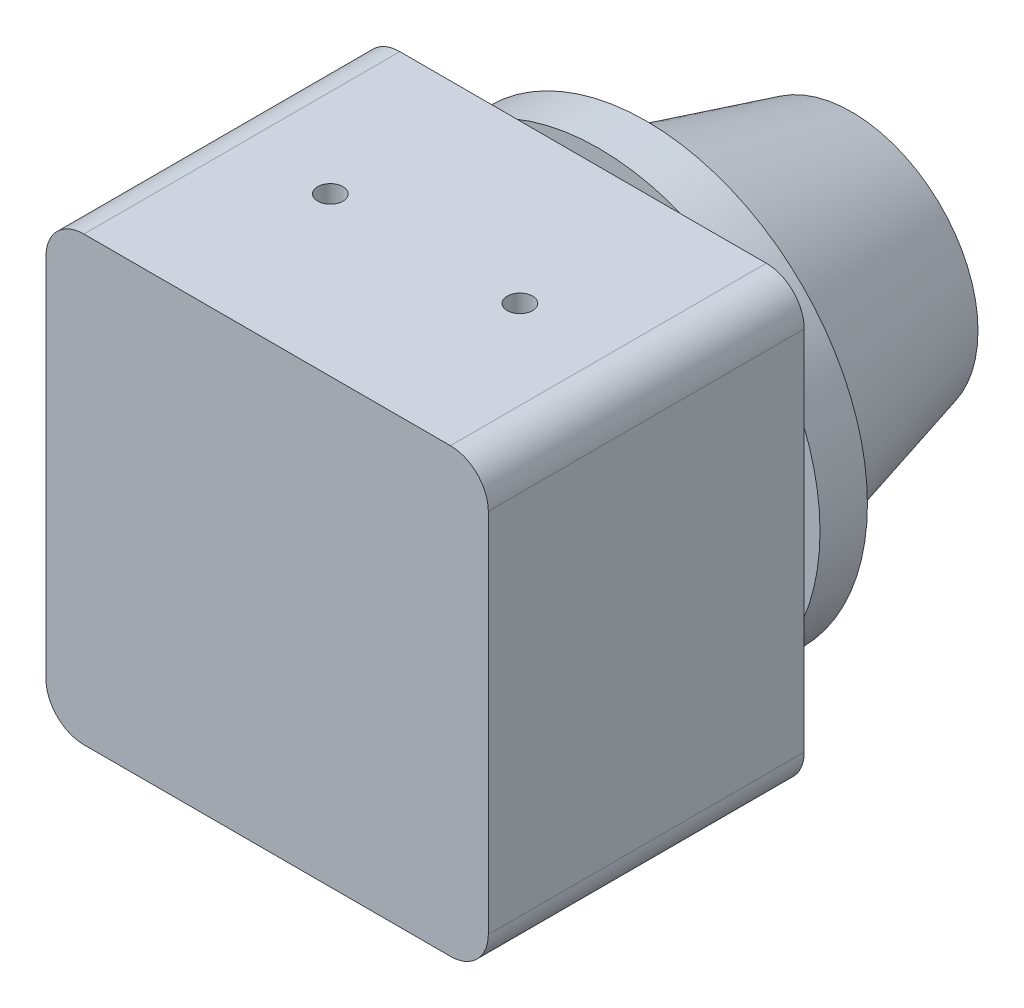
ISO-10303-21;
HEADER;
FILE_DESCRIPTION(('STEP AP214'),'2;1');
FILE_NAME('part.step','',(''),(''),'','','');
FILE_SCHEMA(('AUTOMOTIVE_DESIGN { 1 0 10303 214 1 1 1 1 }'));
ENDSEC;
DATA;
#1=APPLICATION_CONTEXT('core data for automotive mechanical design processes');
#2=APPLICATION_PROTOCOL_DEFINITION('international standard','automotive_design',2000,#1);
#3=PRODUCT_CONTEXT('',#1,'mechanical');
#4=PRODUCT('Part','Part','',(#3));
#5=PRODUCT_RELATED_PRODUCT_CATEGORY('part','',(#4));
#6=PRODUCT_DEFINITION_FORMATION('','',#4);
#7=PRODUCT_DEFINITION_CONTEXT('part definition',#1,'design');
#8=PRODUCT_DEFINITION('design','',#6,#7);
#9=PRODUCT_DEFINITION_SHAPE('','',#8);
#10=(LENGTH_UNIT() NAMED_UNIT(*) SI_UNIT(.MILLI.,.METRE.));
#11=(NAMED_UNIT(*) PLANE_ANGLE_UNIT() SI_UNIT($,.RADIAN.));
#12=(NAMED_UNIT(*) SI_UNIT($,.STERADIAN.) SOLID_ANGLE_UNIT());
#13=UNCERTAINTY_MEASURE_WITH_UNIT(LENGTH_MEASURE(1.E-05),#10,'distance_accuracy_value','');
#14=(GEOMETRIC_REPRESENTATION_CONTEXT(3) GLOBAL_UNCERTAINTY_ASSIGNED_CONTEXT((#13)) GLOBAL_UNIT_ASSIGNED_CONTEXT((#10,
#11,#12)) REPRESENTATION_CONTEXT('',''));
#15=CARTESIAN_POINT('',(0.,0.,0.));
#16=DIRECTION('',(0.,0.,1.));
#17=DIRECTION('',(1.,0.,0.));
#18=AXIS2_PLACEMENT_3D('',#15,#16,#17);
#19=CARTESIAN_POINT('',(158.115,145.415,0.));
#20=DIRECTION('',(0.,0.,1.));
#21=DIRECTION('',(1.,0.,0.));
#22=AXIS2_PLACEMENT_3D('',#19,#20,#21);
#23=PLANE('',#22);
#24=CARTESIAN_POINT('',(158.115,145.415,0.));
#25=DIRECTION('',(0.,0.,1.));
#26=DIRECTION('',(1.,0.,0.));
#27=AXIS2_PLACEMENT_3D('',#24,#25,#26);
#28=CIRCLE('',#27,3.81000000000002);
#29=CARTESIAN_POINT('',(161.925,145.415,0.));
#30=VERTEX_POINT('',#29);
#31=CARTESIAN_POINT('',(158.115,149.225,0.));
#32=VERTEX_POINT('',#31);
#33=EDGE_CURVE('E132',#30,#32,#28,.T.);
#34=ORIENTED_EDGE('',*,*,#33,.F.);
#35=DIRECTION('',(0.,1.,0.));
#36=VECTOR('',#35,1.);
#37=CARTESIAN_POINT('',(161.925,145.415,0.));
#38=LINE('',#37,#36);
#39=CARTESIAN_POINT('',(161.925,108.585,0.));
#40=VERTEX_POINT('',#39);
#41=EDGE_CURVE('E86',#40,#30,#38,.T.);
#42=ORIENTED_EDGE('',*,*,#41,.F.);
#43=CARTESIAN_POINT('',(158.115,108.585,0.));
#44=DIRECTION('',(0.,0.,1.));
#45=DIRECTION('',(1.,0.,0.));
#46=AXIS2_PLACEMENT_3D('',#43,#44,#45);
#47=CIRCLE('',#46,3.80999999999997);
#48=CARTESIAN_POINT('',(158.115,104.775,0.));
#49=VERTEX_POINT('',#48);
#50=EDGE_CURVE('E80',#49,#40,#47,.T.);
#51=ORIENTED_EDGE('',*,*,#50,.F.);
#52=DIRECTION('',(1.,0.,0.));
#53=VECTOR('',#52,1.);
#54=CARTESIAN_POINT('',(158.115,104.775,0.));
#55=LINE('',#54,#53);
#56=CARTESIAN_POINT('',(121.285,104.775,0.));
#57=VERTEX_POINT('',#56);
#58=EDGE_CURVE('E122',#57,#49,#55,.T.);
#59=ORIENTED_EDGE('',*,*,#58,.F.);
#60=CARTESIAN_POINT('',(121.285,108.585,0.));
#61=DIRECTION('',(0.,0.,1.));
#62=DIRECTION('',(-1.,0.,0.));
#63=AXIS2_PLACEMENT_3D('',#60,#61,#62);
#64=CIRCLE('',#63,3.80999999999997);
#65=CARTESIAN_POINT('',(117.475,108.585,0.));
#66=VERTEX_POINT('',#65);
#67=EDGE_CURVE('E142',#66,#57,#64,.T.);
#68=ORIENTED_EDGE('',*,*,#67,.F.);
#69=DIRECTION('',(0.,-1.,0.));
#70=VECTOR('',#69,1.);
#71=CARTESIAN_POINT('',(117.475,145.415,0.));
#72=LINE('',#71,#70);
#73=CARTESIAN_POINT('',(117.475,145.415,0.));
#74=VERTEX_POINT('',#73);
#75=EDGE_CURVE('E140',#74,#66,#72,.T.);
#76=ORIENTED_EDGE('',*,*,#75,.F.);
#77=CARTESIAN_POINT('',(121.285,145.415,0.));
#78=DIRECTION('',(0.,0.,1.));
#79=DIRECTION('',(-1.,0.,0.));
#80=AXIS2_PLACEMENT_3D('',#77,#78,#79);
#81=CIRCLE('',#80,3.81);
#82=CARTESIAN_POINT('',(121.285,149.225,0.));
#83=VERTEX_POINT('',#82);
#84=EDGE_CURVE('E138',#83,#74,#81,.T.);
#85=ORIENTED_EDGE('',*,*,#84,.F.);
#86=DIRECTION('',(-1.,0.,0.));
#87=VECTOR('',#86,1.);
#88=CARTESIAN_POINT('',(158.115,149.225,0.));
#89=LINE('',#88,#87);
#90=EDGE_CURVE('E135',#32,#83,#89,.T.);
#91=ORIENTED_EDGE('',*,*,#90,.F.);
#92=EDGE_LOOP('',(#34,#42,#51,#59,#68,#76,#85,#91));
#93=FACE_BOUND('',#92,.T.);
#94=CARTESIAN_POINT('',(139.7,127.,0.));
#95=DIRECTION('',(0.,0.,1.));
#96=DIRECTION('',(1.,0.,0.));
#97=AXIS2_PLACEMENT_3D('',#94,#95,#96);
#98=CIRCLE('',#97,13.97);
#99=CARTESIAN_POINT('',(153.67,127.,0.));
#100=VERTEX_POINT('',#99);
#101=EDGE_CURVE('E11',#100,#100,#98,.F.);
#102=ORIENTED_EDGE('',*,*,#101,.F.);
#103=EDGE_LOOP('',(#102));
#104=FACE_BOUND('',#103,.T.);
#105=ADVANCED_FACE('F34',(#93,#104),#23,.F.);
#106=CARTESIAN_POINT('',(158.115,145.415,31.75));
#107=DIRECTION('',(0.,0.,-1.));
#108=DIRECTION('',(-1.,0.,0.));
#109=AXIS2_PLACEMENT_3D('',#106,#107,#108);
#110=CYLINDRICAL_SURFACE('',#109,3.81000000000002);
#111=ORIENTED_EDGE('',*,*,#33,.T.);
#112=DIRECTION('',(0.,0.,-1.));
#113=VECTOR('',#112,1.);
#114=CARTESIAN_POINT('',(158.115,149.225,31.75));
#115=LINE('',#114,#113);
#116=CARTESIAN_POINT('',(158.115,149.225,31.75));
#117=VERTEX_POINT('',#116);
#118=EDGE_CURVE('E43',#117,#32,#115,.T.);
#119=ORIENTED_EDGE('',*,*,#118,.F.);
#120=CARTESIAN_POINT('',(158.115,145.415,31.75));
#121=DIRECTION('',(0.,0.,1.));
#122=DIRECTION('',(1.,0.,0.));
#123=AXIS2_PLACEMENT_3D('',#120,#121,#122);
#124=CIRCLE('',#123,3.81000000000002);
#125=CARTESIAN_POINT('',(161.925,145.415,31.75));
#126=VERTEX_POINT('',#125);
#127=EDGE_CURVE('E147',#126,#117,#124,.T.);
#128=ORIENTED_EDGE('',*,*,#127,.F.);
#129=DIRECTION('',(0.,0.,-1.));
#130=VECTOR('',#129,1.);
#131=CARTESIAN_POINT('',(161.925,145.415,31.75));
#132=LINE('',#131,#130);
#133=EDGE_CURVE('E128',#126,#30,#132,.T.);
#134=ORIENTED_EDGE('',*,*,#133,.T.);
#135=EDGE_LOOP('',(#111,#119,#128,#134));
#136=FACE_BOUND('',#135,.T.);
#137=ADVANCED_FACE('F36',(#136),#110,.T.);
#138=CARTESIAN_POINT('',(158.115,149.225,31.75));
#139=DIRECTION('',(0.,-1.,0.));
#140=DIRECTION('',(1.,0.,0.));
#141=AXIS2_PLACEMENT_3D('',#138,#139,#140);
#142=PLANE('',#141);
#143=CARTESIAN_POINT('',(149.225,149.225,15.875));
#144=DIRECTION('',(0.,1.,0.));
#145=DIRECTION('',(-1.,0.,0.));
#146=AXIS2_PLACEMENT_3D('',#143,#144,#145);
#147=CIRCLE('',#146,1.27);
#148=CARTESIAN_POINT('',(147.955,149.225,15.875));
#149=VERTEX_POINT('',#148);
#150=EDGE_CURVE('E205',#149,#149,#147,.T.);
#151=ORIENTED_EDGE('',*,*,#150,.F.);
#152=EDGE_LOOP('',(#151));
#153=FACE_BOUND('',#152,.T.);
#154=CARTESIAN_POINT('',(130.175,149.225,15.875));
#155=DIRECTION('',(0.,1.,0.));
#156=DIRECTION('',(-1.,0.,0.));
#157=AXIS2_PLACEMENT_3D('',#154,#155,#156);
#158=CIRCLE('',#157,1.27);
#159=CARTESIAN_POINT('',(128.905,149.225,15.875));
#160=VERTEX_POINT('',#159);
#161=EDGE_CURVE('E199',#160,#160,#158,.T.);
#162=ORIENTED_EDGE('',*,*,#161,.F.);
#163=EDGE_LOOP('',(#162));
#164=FACE_BOUND('',#163,.T.);
#165=ORIENTED_EDGE('',*,*,#90,.T.);
#166=DIRECTION('',(0.,0.,-1.));
#167=VECTOR('',#166,1.);
#168=CARTESIAN_POINT('',(121.285,149.225,31.75));
#169=LINE('',#168,#167);
#170=CARTESIAN_POINT('',(121.285,149.225,31.75));
#171=VERTEX_POINT('',#170);
#172=EDGE_CURVE('E157',#171,#83,#169,.T.);
#173=ORIENTED_EDGE('',*,*,#172,.F.);
#174=DIRECTION('',(-1.,0.,0.));
#175=VECTOR('',#174,1.);
#176=CARTESIAN_POINT('',(158.115,149.225,31.75));
#177=LINE('',#176,#175);
#178=EDGE_CURVE('E95',#117,#171,#177,.T.);
#179=ORIENTED_EDGE('',*,*,#178,.F.);
#180=ORIENTED_EDGE('',*,*,#118,.T.);
#181=EDGE_LOOP('',(#165,#173,#179,#180));
#182=FACE_BOUND('',#181,.T.);
#183=ADVANCED_FACE('F160',(#153,#164,#182),#142,.F.);
#184=CARTESIAN_POINT('',(121.285,145.415,31.75));
#185=DIRECTION('',(0.,0.,-1.));
#186=DIRECTION('',(-1.,0.,0.));
#187=AXIS2_PLACEMENT_3D('',#184,#185,#186);
#188=CYLINDRICAL_SURFACE('',#187,3.81);
#189=ORIENTED_EDGE('',*,*,#84,.T.);
#190=DIRECTION('',(0.,0.,-1.));
#191=VECTOR('',#190,1.);
#192=CARTESIAN_POINT('',(117.475,145.415,31.75));
#193=LINE('',#192,#191);
#194=CARTESIAN_POINT('',(117.475,145.415,31.75));
#195=VERTEX_POINT('',#194);
#196=EDGE_CURVE('E154',#195,#74,#193,.T.);
#197=ORIENTED_EDGE('',*,*,#196,.F.);
#198=CARTESIAN_POINT('',(121.285,145.415,31.75));
#199=DIRECTION('',(0.,0.,1.));
#200=DIRECTION('',(-1.,0.,0.));
#201=AXIS2_PLACEMENT_3D('',#198,#199,#200);
#202=CIRCLE('',#201,3.81);
#203=EDGE_CURVE('E178',#171,#195,#202,.T.);
#204=ORIENTED_EDGE('',*,*,#203,.F.);
#205=ORIENTED_EDGE('',*,*,#172,.T.);
#206=EDGE_LOOP('',(#189,#197,#204,#205));
#207=FACE_BOUND('',#206,.T.);
#208=ADVANCED_FACE('F171',(#207),#188,.T.);
#209=CARTESIAN_POINT('',(117.475,145.415,31.75));
#210=DIRECTION('',(1.,0.,0.));
#211=DIRECTION('',(0.,0.,-1.));
#212=AXIS2_PLACEMENT_3D('',#209,#210,#211);
#213=PLANE('',#212);
#214=ORIENTED_EDGE('',*,*,#75,.T.);
#215=DIRECTION('',(0.,0.,-1.));
#216=VECTOR('',#215,1.);
#217=CARTESIAN_POINT('',(117.475,108.585,31.75));
#218=LINE('',#217,#216);
#219=CARTESIAN_POINT('',(117.475,108.585,31.75));
#220=VERTEX_POINT('',#219);
#221=EDGE_CURVE('E151',#220,#66,#218,.T.);
#222=ORIENTED_EDGE('',*,*,#221,.F.);
#223=DIRECTION('',(0.,-1.,0.));
#224=VECTOR('',#223,1.);
#225=CARTESIAN_POINT('',(117.475,145.415,31.75));
#226=LINE('',#225,#224);
#227=EDGE_CURVE('E177',#195,#220,#226,.T.);
#228=ORIENTED_EDGE('',*,*,#227,.F.);
#229=ORIENTED_EDGE('',*,*,#196,.T.);
#230=EDGE_LOOP('',(#214,#222,#228,#229));
#231=FACE_BOUND('',#230,.T.);
#232=ADVANCED_FACE('F175',(#231),#213,.F.);
#233=CARTESIAN_POINT('',(121.285,108.585,31.75));
#234=DIRECTION('',(0.,0.,-1.));
#235=DIRECTION('',(-1.,0.,0.));
#236=AXIS2_PLACEMENT_3D('',#233,#234,#235);
#237=CYLINDRICAL_SURFACE('',#236,3.80999999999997);
#238=ORIENTED_EDGE('',*,*,#67,.T.);
#239=DIRECTION('',(0.,0.,-1.));
#240=VECTOR('',#239,1.);
#241=CARTESIAN_POINT('',(121.285,104.775,31.75));
#242=LINE('',#241,#240);
#243=CARTESIAN_POINT('',(121.285,104.775,31.75));
#244=VERTEX_POINT('',#243);
#245=EDGE_CURVE('E123',#244,#57,#242,.T.);
#246=ORIENTED_EDGE('',*,*,#245,.F.);
#247=CARTESIAN_POINT('',(121.285,108.585,31.75));
#248=DIRECTION('',(0.,0.,1.));
#249=DIRECTION('',(-1.,0.,0.));
#250=AXIS2_PLACEMENT_3D('',#247,#248,#249);
#251=CIRCLE('',#250,3.80999999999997);
#252=EDGE_CURVE('E114',#220,#244,#251,.T.);
#253=ORIENTED_EDGE('',*,*,#252,.F.);
#254=ORIENTED_EDGE('',*,*,#221,.T.);
#255=EDGE_LOOP('',(#238,#246,#253,#254));
#256=FACE_BOUND('',#255,.T.);
#257=ADVANCED_FACE('F250',(#256),#237,.T.);
#258=CARTESIAN_POINT('',(158.115,104.775,31.75));
#259=DIRECTION('',(0.,1.,0.));
#260=DIRECTION('',(0.,0.,1.));
#261=AXIS2_PLACEMENT_3D('',#258,#259,#260);
#262=PLANE('',#261);
#263=CARTESIAN_POINT('',(149.225,104.775,15.875));
#264=DIRECTION('',(0.,1.,0.));
#265=DIRECTION('',(-1.,0.,0.));
#266=AXIS2_PLACEMENT_3D('',#263,#264,#265);
#267=CIRCLE('',#266,1.27);
#268=CARTESIAN_POINT('',(147.955,104.775,15.875));
#269=VERTEX_POINT('',#268);
#270=EDGE_CURVE('E202',#269,#269,#267,.T.);
#271=ORIENTED_EDGE('',*,*,#270,.T.);
#272=EDGE_LOOP('',(#271));
#273=FACE_BOUND('',#272,.T.);
#274=CARTESIAN_POINT('',(130.175,104.775,15.875));
#275=DIRECTION('',(0.,1.,0.));
#276=DIRECTION('',(-1.,0.,0.));
#277=AXIS2_PLACEMENT_3D('',#274,#275,#276);
#278=CIRCLE('',#277,1.27);
#279=CARTESIAN_POINT('',(128.905,104.775,15.875));
#280=VERTEX_POINT('',#279);
#281=EDGE_CURVE('E198',#280,#280,#278,.T.);
#282=ORIENTED_EDGE('',*,*,#281,.T.);
#283=EDGE_LOOP('',(#282));
#284=FACE_BOUND('',#283,.T.);
#285=ORIENTED_EDGE('',*,*,#58,.T.);
#286=DIRECTION('',(0.,0.,-1.));
#287=VECTOR('',#286,1.);
#288=CARTESIAN_POINT('',(158.115,104.775,31.75));
#289=LINE('',#288,#287);
#290=CARTESIAN_POINT('',(158.115,104.775,31.75));
#291=VERTEX_POINT('',#290);
#292=EDGE_CURVE('E119',#291,#49,#289,.T.);
#293=ORIENTED_EDGE('',*,*,#292,.F.);
#294=DIRECTION('',(1.,0.,0.));
#295=VECTOR('',#294,1.);
#296=CARTESIAN_POINT('',(158.115,104.775,31.75));
#297=LINE('',#296,#295);
#298=EDGE_CURVE('E108',#244,#291,#297,.T.);
#299=ORIENTED_EDGE('',*,*,#298,.F.);
#300=ORIENTED_EDGE('',*,*,#245,.T.);
#301=EDGE_LOOP('',(#285,#293,#299,#300));
#302=FACE_BOUND('',#301,.T.);
#303=ADVANCED_FACE('F120',(#273,#284,#302),#262,.F.);
#304=CARTESIAN_POINT('',(158.115,108.585,31.75));
#305=DIRECTION('',(0.,0.,-1.));
#306=DIRECTION('',(-1.,0.,0.));
#307=AXIS2_PLACEMENT_3D('',#304,#305,#306);
#308=CYLINDRICAL_SURFACE('',#307,3.80999999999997);
#309=ORIENTED_EDGE('',*,*,#50,.T.);
#310=DIRECTION('',(0.,0.,-1.));
#311=VECTOR('',#310,1.);
#312=CARTESIAN_POINT('',(161.925,108.585,31.75));
#313=LINE('',#312,#311);
#314=CARTESIAN_POINT('',(161.925,108.585,31.75));
#315=VERTEX_POINT('',#314);
#316=EDGE_CURVE('E124',#315,#40,#313,.T.);
#317=ORIENTED_EDGE('',*,*,#316,.F.);
#318=CARTESIAN_POINT('',(158.115,108.585,31.75));
#319=DIRECTION('',(0.,0.,1.));
#320=DIRECTION('',(1.,0.,0.));
#321=AXIS2_PLACEMENT_3D('',#318,#319,#320);
#322=CIRCLE('',#321,3.80999999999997);
#323=EDGE_CURVE('E112',#291,#315,#322,.T.);
#324=ORIENTED_EDGE('',*,*,#323,.F.);
#325=ORIENTED_EDGE('',*,*,#292,.T.);
#326=EDGE_LOOP('',(#309,#317,#324,#325));
#327=FACE_BOUND('',#326,.T.);
#328=ADVANCED_FACE('F126',(#327),#308,.T.);
#329=CARTESIAN_POINT('',(161.925,145.415,31.75));
#330=DIRECTION('',(-1.,0.,0.));
#331=DIRECTION('',(0.,0.,1.));
#332=AXIS2_PLACEMENT_3D('',#329,#330,#331);
#333=PLANE('',#332);
#334=ORIENTED_EDGE('',*,*,#41,.T.);
#335=ORIENTED_EDGE('',*,*,#133,.F.);
#336=DIRECTION('',(0.,1.,0.));
#337=VECTOR('',#336,1.);
#338=CARTESIAN_POINT('',(161.925,145.415,31.75));
#339=LINE('',#338,#337);
#340=EDGE_CURVE('E51',#315,#126,#339,.T.);
#341=ORIENTED_EDGE('',*,*,#340,.F.);
#342=ORIENTED_EDGE('',*,*,#316,.T.);
#343=EDGE_LOOP('',(#334,#335,#341,#342));
#344=FACE_BOUND('',#343,.T.);
#345=ADVANCED_FACE('F243',(#344),#333,.F.);
#346=CARTESIAN_POINT('',(158.115,145.415,31.75));
#347=DIRECTION('',(0.,0.,1.));
#348=DIRECTION('',(1.,0.,0.));
#349=AXIS2_PLACEMENT_3D('',#346,#347,#348);
#350=PLANE('',#349);
#351=ORIENTED_EDGE('',*,*,#127,.T.);
#352=ORIENTED_EDGE('',*,*,#178,.T.);
#353=ORIENTED_EDGE('',*,*,#203,.T.);
#354=ORIENTED_EDGE('',*,*,#227,.T.);
#355=ORIENTED_EDGE('',*,*,#252,.T.);
#356=ORIENTED_EDGE('',*,*,#298,.T.);
#357=ORIENTED_EDGE('',*,*,#323,.T.);
#358=ORIENTED_EDGE('',*,*,#340,.T.);
#359=EDGE_LOOP('',(#351,#352,#353,#354,#355,#356,#357,#358));
#360=FACE_BOUND('',#359,.T.);
#361=ADVANCED_FACE('F110',(#360),#350,.T.);
#362=CARTESIAN_POINT('',(139.7,127.,-26.9875));
#363=DIRECTION('',(0.,0.,1.));
#364=DIRECTION('',(1.,0.,0.));
#365=AXIS2_PLACEMENT_3D('',#362,#363,#364);
#366=PLANE('',#365);
#367=CARTESIAN_POINT('',(139.7,127.,-26.9875));
#368=DIRECTION('',(0.,0.,1.));
#369=DIRECTION('',(1.,0.,0.));
#370=AXIS2_PLACEMENT_3D('',#367,#368,#369);
#371=CIRCLE('',#370,12.7);
#372=CARTESIAN_POINT('',(152.4,127.,-26.9875));
#373=VERTEX_POINT('',#372);
#374=EDGE_CURVE('E136',#373,#373,#371,.T.);
#375=ORIENTED_EDGE('',*,*,#374,.F.);
#376=EDGE_LOOP('',(#375));
#377=FACE_BOUND('',#376,.T.);
#378=ADVANCED_FACE('F288',(#377),#366,.F.);
#379=CARTESIAN_POINT('',(139.7,127.,-26.9875));
#380=DIRECTION('',(0.,0.,1.));
#381=DIRECTION('',(1.,0.,0.));
#382=AXIS2_PLACEMENT_3D('',#379,#380,#381);
#383=CONICAL_SURFACE('',#382,12.7,0.261799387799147);
#384=CARTESIAN_POINT('',(139.7,127.,-6.34999999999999));
#385=DIRECTION('',(0.,0.,1.));
#386=DIRECTION('',(1.,0.,0.));
#387=AXIS2_PLACEMENT_3D('',#384,#385,#386);
#388=CIRCLE('',#387,18.2298014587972);
#389=CARTESIAN_POINT('',(157.929801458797,127.,-6.34999999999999));
#390=VERTEX_POINT('',#389);
#391=EDGE_CURVE('E186',#390,#390,#388,.T.);
#392=ORIENTED_EDGE('',*,*,#391,.F.);
#393=EDGE_LOOP('',(#392));
#394=FACE_BOUND('',#393,.T.);
#395=ORIENTED_EDGE('',*,*,#374,.T.);
#396=EDGE_LOOP('',(#395));
#397=FACE_BOUND('',#396,.T.);
#398=ADVANCED_FACE('F294',(#394,#397),#383,.T.);
#399=CARTESIAN_POINT('',(139.7,145.229801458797,-6.34999999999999));
#400=DIRECTION('',(0.,0.,1.));
#401=DIRECTION('',(1.,0.,0.));
#402=AXIS2_PLACEMENT_3D('',#399,#400,#401);
#403=PLANE('',#402);
#404=CARTESIAN_POINT('',(139.7,127.,-6.34999999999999));
#405=DIRECTION('',(0.,0.,1.));
#406=DIRECTION('',(1.,0.,0.));
#407=AXIS2_PLACEMENT_3D('',#404,#405,#406);
#408=CIRCLE('',#407,22.225);
#409=CARTESIAN_POINT('',(161.925,127.,-6.34999999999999));
#410=VERTEX_POINT('',#409);
#411=EDGE_CURVE('E189',#410,#410,#408,.T.);
#412=ORIENTED_EDGE('',*,*,#411,.F.);
#413=EDGE_LOOP('',(#412));
#414=FACE_BOUND('',#413,.T.);
#415=ORIENTED_EDGE('',*,*,#391,.T.);
#416=EDGE_LOOP('',(#415));
#417=FACE_BOUND('',#416,.T.);
#418=ADVANCED_FACE('F301',(#414,#417),#403,.F.);
#419=CARTESIAN_POINT('',(139.7,127.,0.));
#420=DIRECTION('',(0.,0.,1.));
#421=DIRECTION('',(1.,0.,0.));
#422=AXIS2_PLACEMENT_3D('',#419,#420,#421);
#423=CYLINDRICAL_SURFACE('',#422,22.225);
#424=CARTESIAN_POINT('',(139.7,127.,-1.58749999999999));
#425=DIRECTION('',(0.,0.,1.));
#426=DIRECTION('',(1.,0.,0.));
#427=AXIS2_PLACEMENT_3D('',#424,#425,#426);
#428=CIRCLE('',#427,22.225);
#429=CARTESIAN_POINT('',(161.925,127.,-1.58749999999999));
#430=VERTEX_POINT('',#429);
#431=EDGE_CURVE('E192',#430,#430,#428,.T.);
#432=ORIENTED_EDGE('',*,*,#431,.F.);
#433=EDGE_LOOP('',(#432));
#434=FACE_BOUND('',#433,.T.);
#435=ORIENTED_EDGE('',*,*,#411,.T.);
#436=EDGE_LOOP('',(#435));
#437=FACE_BOUND('',#436,.T.);
#438=ADVANCED_FACE('F309',(#434,#437),#423,.T.);
#439=CARTESIAN_POINT('',(139.7,149.225,-1.58750000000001));
#440=DIRECTION('',(0.,0.,-1.));
#441=DIRECTION('',(-1.,0.,0.));
#442=AXIS2_PLACEMENT_3D('',#439,#440,#441);
#443=PLANE('',#442);
#444=CARTESIAN_POINT('',(139.7,127.,-1.58750000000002));
#445=DIRECTION('',(0.,0.,1.));
#446=DIRECTION('',(1.,0.,0.));
#447=AXIS2_PLACEMENT_3D('',#444,#445,#446);
#448=CIRCLE('',#447,13.97);
#449=CARTESIAN_POINT('',(153.67,127.,-1.58750000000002));
#450=VERTEX_POINT('',#449);
#451=EDGE_CURVE('E195',#450,#450,#448,.T.);
#452=ORIENTED_EDGE('',*,*,#451,.F.);
#453=EDGE_LOOP('',(#452));
#454=FACE_BOUND('',#453,.T.);
#455=ORIENTED_EDGE('',*,*,#431,.T.);
#456=EDGE_LOOP('',(#455));
#457=FACE_BOUND('',#456,.T.);
#458=ADVANCED_FACE('F231',(#454,#457),#443,.F.);
#459=CARTESIAN_POINT('',(139.7,127.,0.));
#460=DIRECTION('',(0.,0.,1.));
#461=DIRECTION('',(1.,0.,0.));
#462=AXIS2_PLACEMENT_3D('',#459,#460,#461);
#463=CYLINDRICAL_SURFACE('',#462,13.97);
#464=ORIENTED_EDGE('',*,*,#101,.T.);
#465=EDGE_LOOP('',(#464));
#466=FACE_BOUND('',#465,.T.);
#467=ORIENTED_EDGE('',*,*,#451,.T.);
#468=EDGE_LOOP('',(#467));
#469=FACE_BOUND('',#468,.T.);
#470=ADVANCED_FACE('F225',(#466,#469),#463,.T.);
#471=CARTESIAN_POINT('',(130.175,104.775,15.875));
#472=DIRECTION('',(0.,1.,0.));
#473=DIRECTION('',(-1.,0.,0.));
#474=AXIS2_PLACEMENT_3D('',#471,#472,#473);
#475=CYLINDRICAL_SURFACE('',#474,1.27);
#476=CARTESIAN_POINT('',(128.905,104.775,15.875));
#477=CARTESIAN_POINT('',(128.905,105.238020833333,15.875));
#478=CARTESIAN_POINT('',(128.905,105.701041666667,15.875));
#479=CARTESIAN_POINT('',(128.905,106.627083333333,15.875));
#480=CARTESIAN_POINT('',(128.905,107.090104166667,15.875));
#481=CARTESIAN_POINT('',(128.905,108.016145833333,15.875));
#482=CARTESIAN_POINT('',(128.905,108.479166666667,15.875));
#483=CARTESIAN_POINT('',(128.905,109.405208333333,15.875));
#484=CARTESIAN_POINT('',(128.905,109.868229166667,15.875));
#485=CARTESIAN_POINT('',(128.905,110.794270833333,15.875));
#486=CARTESIAN_POINT('',(128.905,111.257291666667,15.875));
#487=CARTESIAN_POINT('',(128.905,112.183333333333,15.875));
#488=CARTESIAN_POINT('',(128.905,112.646354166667,15.875));
#489=CARTESIAN_POINT('',(128.905,113.572395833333,15.875));
#490=CARTESIAN_POINT('',(128.905,114.035416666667,15.875));
#491=CARTESIAN_POINT('',(128.905,114.961458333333,15.875));
#492=CARTESIAN_POINT('',(128.905,115.424479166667,15.875));
#493=CARTESIAN_POINT('',(128.905,116.350520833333,15.875));
#494=CARTESIAN_POINT('',(128.905,116.813541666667,15.875));
#495=CARTESIAN_POINT('',(128.905,117.739583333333,15.875));
#496=CARTESIAN_POINT('',(128.905,118.202604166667,15.875));
#497=CARTESIAN_POINT('',(128.905,119.128645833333,15.875));
#498=CARTESIAN_POINT('',(128.905,119.591666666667,15.875));
#499=CARTESIAN_POINT('',(128.905,120.517708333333,15.875));
#500=CARTESIAN_POINT('',(128.905,120.980729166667,15.875));
#501=CARTESIAN_POINT('',(128.905,121.906770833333,15.875));
#502=CARTESIAN_POINT('',(128.905,122.369791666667,15.875));
#503=CARTESIAN_POINT('',(128.905,123.295833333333,15.875));
#504=CARTESIAN_POINT('',(128.905,123.758854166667,15.875));
#505=CARTESIAN_POINT('',(128.905,124.684895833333,15.875));
#506=CARTESIAN_POINT('',(128.905,125.147916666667,15.875));
#507=CARTESIAN_POINT('',(128.905,126.073958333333,15.875));
#508=CARTESIAN_POINT('',(128.905,126.536979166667,15.875));
#509=CARTESIAN_POINT('',(128.905,127.463020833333,15.875));
#510=CARTESIAN_POINT('',(128.905,127.926041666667,15.875));
#511=CARTESIAN_POINT('',(128.905,128.852083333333,15.875));
#512=CARTESIAN_POINT('',(128.905,129.315104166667,15.875));
#513=CARTESIAN_POINT('',(128.905,130.241145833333,15.875));
#514=CARTESIAN_POINT('',(128.905,130.704166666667,15.875));
#515=CARTESIAN_POINT('',(128.905,131.630208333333,15.875));
#516=CARTESIAN_POINT('',(128.905,132.093229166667,15.875));
#517=CARTESIAN_POINT('',(128.905,133.019270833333,15.875));
#518=CARTESIAN_POINT('',(128.905,133.482291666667,15.875));
#519=CARTESIAN_POINT('',(128.905,134.408333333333,15.875));
#520=CARTESIAN_POINT('',(128.905,134.871354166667,15.875));
#521=CARTESIAN_POINT('',(128.905,135.797395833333,15.875));
#522=CARTESIAN_POINT('',(128.905,136.260416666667,15.875));
#523=CARTESIAN_POINT('',(128.905,137.186458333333,15.875));
#524=CARTESIAN_POINT('',(128.905,137.649479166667,15.875));
#525=CARTESIAN_POINT('',(128.905,138.575520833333,15.875));
#526=CARTESIAN_POINT('',(128.905,139.038541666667,15.875));
#527=CARTESIAN_POINT('',(128.905,139.964583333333,15.875));
#528=CARTESIAN_POINT('',(128.905,140.427604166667,15.875));
#529=CARTESIAN_POINT('',(128.905,141.353645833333,15.875));
#530=CARTESIAN_POINT('',(128.905,141.816666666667,15.875));
#531=CARTESIAN_POINT('',(128.905,142.742708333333,15.875));
#532=CARTESIAN_POINT('',(128.905,143.205729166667,15.875));
#533=CARTESIAN_POINT('',(128.905,144.131770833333,15.875));
#534=CARTESIAN_POINT('',(128.905,144.594791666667,15.875));
#535=CARTESIAN_POINT('',(128.905,145.520833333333,15.875));
#536=CARTESIAN_POINT('',(128.905,145.983854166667,15.875));
#537=CARTESIAN_POINT('',(128.905,146.909895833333,15.875));
#538=CARTESIAN_POINT('',(128.905,147.372916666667,15.875));
#539=CARTESIAN_POINT('',(128.905,148.298958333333,15.875));
#540=CARTESIAN_POINT('',(128.905,148.761979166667,15.875));
#541=CARTESIAN_POINT('',(128.905,149.225,15.875));
#542=B_SPLINE_CURVE_WITH_KNOTS('',3,(#476,#477,#478,#479,#480,#481,#482,#483,#484,#485,#486,
#487,#488,#489,#490,#491,#492,#493,#494,#495,#496,#497,#498,#499,#500,#501,#502,#503,#504,#505,
#506,#507,#508,#509,#510,#511,#512,#513,#514,#515,#516,#517,#518,#519,#520,#521,#522,#523,#524,
#525,#526,#527,#528,#529,#530,#531,#532,#533,#534,#535,#536,#537,#538,#539,#540,#541),
.UNSPECIFIED.,.F.,.F.,(4,2,2,2,2,2,2,2,2,2,2,2,2,2,2,2,2,2,2,2,2,2,2,2,2,2,2,2,2,2,2,2,4),(0.,
1.38906250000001,2.77812500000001,4.16718750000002,5.55625000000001,6.94531250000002,
8.33437500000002,9.72343750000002,11.1125,12.5015625,13.890625,15.2796875,16.66875,18.0578125,
19.446875,20.8359375,22.225,23.6140625,25.003125,26.3921875,27.78125,29.1703125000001,30.559375,
31.9484375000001,33.3375000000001,34.7265625,36.1156250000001,37.5046875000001,38.89375,
40.2828125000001,41.6718750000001,43.0609375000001,44.4500000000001),.UNSPECIFIED.);
#543=EDGE_CURVE('BSEAM216',#280,#160,#542,.T.);
#544=ORIENTED_EDGE('',*,*,#281,.F.);
#545=ORIENTED_EDGE('',*,*,#161,.T.);
#546=ORIENTED_EDGE('',*,*,#543,.T.);
#547=ORIENTED_EDGE('',*,*,#543,.F.);
#548=EDGE_LOOP('',(#544,#546,#545,#547));
#549=FACE_BOUND('',#548,.T.);
#550=ADVANCED_FACE('F216',(#549),#475,.F.);
#551=CARTESIAN_POINT('',(149.225,104.775,15.875));
#552=DIRECTION('',(0.,1.,0.));
#553=DIRECTION('',(-1.,0.,0.));
#554=AXIS2_PLACEMENT_3D('',#551,#552,#553);
#555=CYLINDRICAL_SURFACE('',#554,1.27);
#556=CARTESIAN_POINT('',(147.955,104.775,15.875));
#557=CARTESIAN_POINT('',(147.955,105.238020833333,15.875));
#558=CARTESIAN_POINT('',(147.955,105.701041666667,15.875));
#559=CARTESIAN_POINT('',(147.955,106.627083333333,15.875));
#560=CARTESIAN_POINT('',(147.955,107.090104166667,15.875));
#561=CARTESIAN_POINT('',(147.955,108.016145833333,15.875));
#562=CARTESIAN_POINT('',(147.955,108.479166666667,15.875));
#563=CARTESIAN_POINT('',(147.955,109.405208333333,15.875));
#564=CARTESIAN_POINT('',(147.955,109.868229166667,15.875));
#565=CARTESIAN_POINT('',(147.955,110.794270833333,15.875));
#566=CARTESIAN_POINT('',(147.955,111.257291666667,15.875));
#567=CARTESIAN_POINT('',(147.955,112.183333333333,15.875));
#568=CARTESIAN_POINT('',(147.955,112.646354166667,15.875));
#569=CARTESIAN_POINT('',(147.955,113.572395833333,15.875));
#570=CARTESIAN_POINT('',(147.955,114.035416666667,15.875));
#571=CARTESIAN_POINT('',(147.955,114.961458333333,15.875));
#572=CARTESIAN_POINT('',(147.955,115.424479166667,15.875));
#573=CARTESIAN_POINT('',(147.955,116.350520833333,15.875));
#574=CARTESIAN_POINT('',(147.955,116.813541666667,15.875));
#575=CARTESIAN_POINT('',(147.955,117.739583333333,15.875));
#576=CARTESIAN_POINT('',(147.955,118.202604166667,15.875));
#577=CARTESIAN_POINT('',(147.955,119.128645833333,15.875));
#578=CARTESIAN_POINT('',(147.955,119.591666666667,15.875));
#579=CARTESIAN_POINT('',(147.955,120.517708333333,15.875));
#580=CARTESIAN_POINT('',(147.955,120.980729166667,15.875));
#581=CARTESIAN_POINT('',(147.955,121.906770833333,15.875));
#582=CARTESIAN_POINT('',(147.955,122.369791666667,15.875));
#583=CARTESIAN_POINT('',(147.955,123.295833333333,15.875));
#584=CARTESIAN_POINT('',(147.955,123.758854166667,15.875));
#585=CARTESIAN_POINT('',(147.955,124.684895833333,15.875));
#586=CARTESIAN_POINT('',(147.955,125.147916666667,15.875));
#587=CARTESIAN_POINT('',(147.955,126.073958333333,15.875));
#588=CARTESIAN_POINT('',(147.955,126.536979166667,15.875));
#589=CARTESIAN_POINT('',(147.955,127.463020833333,15.875));
#590=CARTESIAN_POINT('',(147.955,127.926041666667,15.875));
#591=CARTESIAN_POINT('',(147.955,128.852083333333,15.875));
#592=CARTESIAN_POINT('',(147.955,129.315104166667,15.875));
#593=CARTESIAN_POINT('',(147.955,130.241145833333,15.875));
#594=CARTESIAN_POINT('',(147.955,130.704166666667,15.875));
#595=CARTESIAN_POINT('',(147.955,131.630208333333,15.875));
#596=CARTESIAN_POINT('',(147.955,132.093229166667,15.875));
#597=CARTESIAN_POINT('',(147.955,133.019270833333,15.875));
#598=CARTESIAN_POINT('',(147.955,133.482291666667,15.875));
#599=CARTESIAN_POINT('',(147.955,134.408333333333,15.875));
#600=CARTESIAN_POINT('',(147.955,134.871354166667,15.875));
#601=CARTESIAN_POINT('',(147.955,135.797395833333,15.875));
#602=CARTESIAN_POINT('',(147.955,136.260416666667,15.875));
#603=CARTESIAN_POINT('',(147.955,137.186458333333,15.875));
#604=CARTESIAN_POINT('',(147.955,137.649479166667,15.875));
#605=CARTESIAN_POINT('',(147.955,138.575520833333,15.875));
#606=CARTESIAN_POINT('',(147.955,139.038541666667,15.875));
#607=CARTESIAN_POINT('',(147.955,139.964583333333,15.875));
#608=CARTESIAN_POINT('',(147.955,140.427604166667,15.875));
#609=CARTESIAN_POINT('',(147.955,141.353645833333,15.875));
#610=CARTESIAN_POINT('',(147.955,141.816666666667,15.875));
#611=CARTESIAN_POINT('',(147.955,142.742708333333,15.875));
#612=CARTESIAN_POINT('',(147.955,143.205729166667,15.875));
#613=CARTESIAN_POINT('',(147.955,144.131770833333,15.875));
#614=CARTESIAN_POINT('',(147.955,144.594791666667,15.875));
#615=CARTESIAN_POINT('',(147.955,145.520833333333,15.875));
#616=CARTESIAN_POINT('',(147.955,145.983854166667,15.875));
#617=CARTESIAN_POINT('',(147.955,146.909895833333,15.875));
#618=CARTESIAN_POINT('',(147.955,147.372916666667,15.875));
#619=CARTESIAN_POINT('',(147.955,148.298958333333,15.875));
#620=CARTESIAN_POINT('',(147.955,148.761979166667,15.875));
#621=CARTESIAN_POINT('',(147.955,149.225,15.875));
#622=B_SPLINE_CURVE_WITH_KNOTS('',3,(#556,#557,#558,#559,#560,#561,#562,#563,#564,#565,#566,
#567,#568,#569,#570,#571,#572,#573,#574,#575,#576,#577,#578,#579,#580,#581,#582,#583,#584,#585,
#586,#587,#588,#589,#590,#591,#592,#593,#594,#595,#596,#597,#598,#599,#600,#601,#602,#603,#604,
#605,#606,#607,#608,#609,#610,#611,#612,#613,#614,#615,#616,#617,#618,#619,#620,#621),
.UNSPECIFIED.,.F.,.F.,(4,2,2,2,2,2,2,2,2,2,2,2,2,2,2,2,2,2,2,2,2,2,2,2,2,2,2,2,2,2,2,2,4),(0.,
1.38906250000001,2.77812500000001,4.16718750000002,5.55625000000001,6.94531250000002,
8.33437500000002,9.72343750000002,11.1125,12.5015625,13.890625,15.2796875,16.66875,18.0578125,
19.446875,20.8359375,22.225,23.6140625,25.003125,26.3921875,27.78125,29.1703125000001,30.559375,
31.9484375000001,33.3375000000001,34.7265625,36.1156250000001,37.5046875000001,38.89375,
40.2828125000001,41.6718750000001,43.0609375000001,44.4500000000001),.UNSPECIFIED.);
#623=EDGE_CURVE('BSEAM213',#269,#149,#622,.T.);
#624=ORIENTED_EDGE('',*,*,#270,.F.);
#625=ORIENTED_EDGE('',*,*,#150,.T.);
#626=ORIENTED_EDGE('',*,*,#623,.T.);
#627=ORIENTED_EDGE('',*,*,#623,.F.);
#628=EDGE_LOOP('',(#624,#626,#625,#627));
#629=FACE_BOUND('',#628,.T.);
#630=ADVANCED_FACE('F213',(#629),#555,.F.);
#631=CLOSED_SHELL('',(#105,#137,#183,#208,#232,#257,#303,#328,#345,#361,#378,#398,#418,#438,
#458,#470,#550,#630));
#632=MANIFOLD_SOLID_BREP('B2',#631);
#633=ADVANCED_BREP_SHAPE_REPRESENTATION('',(#18,#632),#14);
#634=SHAPE_DEFINITION_REPRESENTATION(#9,#633);
ENDSEC;
END-ISO-10303-21;
